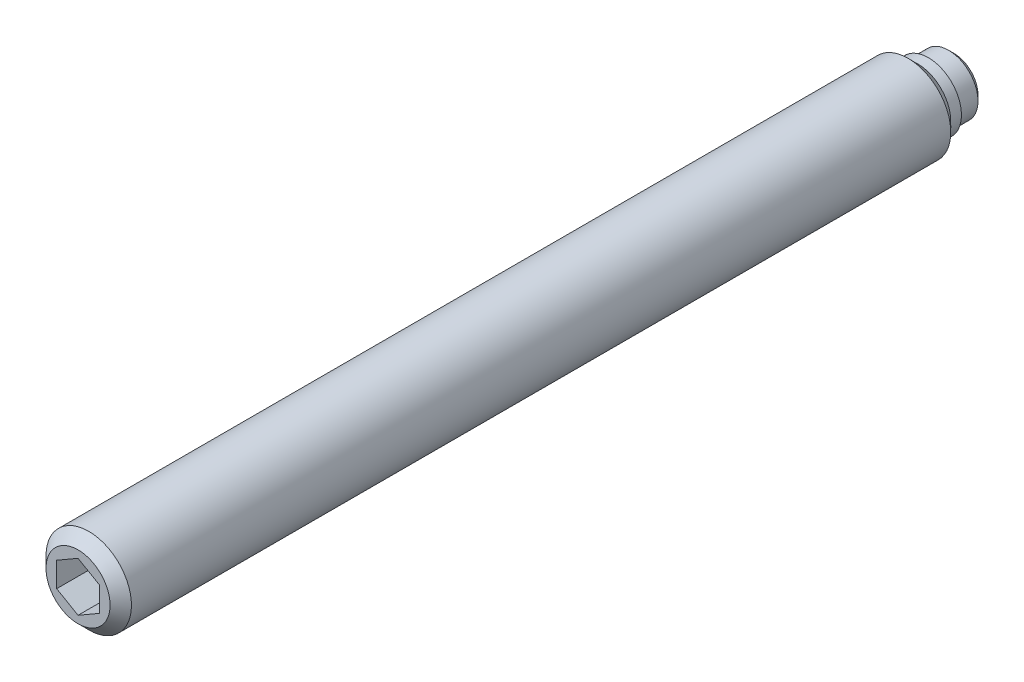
ISO-10303-21;
HEADER;
FILE_DESCRIPTION(('STEP AP214'),'2;1');
FILE_NAME('part.step','',(''),(''),'','','');
FILE_SCHEMA(('AUTOMOTIVE_DESIGN { 1 0 10303 214 1 1 1 1 }'));
ENDSEC;
DATA;
#1=APPLICATION_CONTEXT('core data for automotive mechanical design processes');
#2=APPLICATION_PROTOCOL_DEFINITION('international standard','automotive_design',2000,#1);
#3=PRODUCT_CONTEXT('',#1,'mechanical');
#4=PRODUCT('Part','Part','',(#3));
#5=PRODUCT_RELATED_PRODUCT_CATEGORY('part','',(#4));
#6=PRODUCT_DEFINITION_FORMATION('','',#4);
#7=PRODUCT_DEFINITION_CONTEXT('part definition',#1,'design');
#8=PRODUCT_DEFINITION('design','',#6,#7);
#9=PRODUCT_DEFINITION_SHAPE('','',#8);
#10=(LENGTH_UNIT() NAMED_UNIT(*) SI_UNIT(.MILLI.,.METRE.));
#11=(NAMED_UNIT(*) PLANE_ANGLE_UNIT() SI_UNIT($,.RADIAN.));
#12=(NAMED_UNIT(*) SI_UNIT($,.STERADIAN.) SOLID_ANGLE_UNIT());
#13=UNCERTAINTY_MEASURE_WITH_UNIT(LENGTH_MEASURE(1.E-05),#10,'distance_accuracy_value','');
#14=(GEOMETRIC_REPRESENTATION_CONTEXT(3) GLOBAL_UNCERTAINTY_ASSIGNED_CONTEXT((#13)) GLOBAL_UNIT_ASSIGNED_CONTEXT((#10,
#11,#12)) REPRESENTATION_CONTEXT('',''));
#15=CARTESIAN_POINT('',(0.,0.,0.));
#16=DIRECTION('',(0.,0.,1.));
#17=DIRECTION('',(1.,0.,0.));
#18=AXIS2_PLACEMENT_3D('',#15,#16,#17);
#19=CARTESIAN_POINT('',(0.,0.,2.4));
#20=DIRECTION('',(0.,0.,-1.));
#21=DIRECTION('',(-1.,0.,0.));
#22=AXIS2_PLACEMENT_3D('',#19,#20,#21);
#23=CYLINDRICAL_SURFACE('',#22,4.);
#24=CARTESIAN_POINT('',(0.,0.,4.3));
#25=DIRECTION('',(0.,0.,-1.));
#26=DIRECTION('',(-1.,0.,0.));
#27=AXIS2_PLACEMENT_3D('',#24,#25,#26);
#28=CIRCLE('',#27,4.);
#29=CARTESIAN_POINT('',(-4.,0.,4.3));
#30=VERTEX_POINT('',#29);
#31=EDGE_CURVE('E9',#30,#30,#28,.T.);
#32=ORIENTED_EDGE('',*,*,#31,.F.);
#33=EDGE_LOOP('',(#32));
#34=FACE_BOUND('',#33,.T.);
#35=CARTESIAN_POINT('',(0.,0.,81.));
#36=DIRECTION('',(0.,0.,1.));
#37=DIRECTION('',(1.,0.,0.));
#38=AXIS2_PLACEMENT_3D('',#35,#36,#37);
#39=CIRCLE('',#38,4.);
#40=CARTESIAN_POINT('',(4.,0.,81.));
#41=VERTEX_POINT('',#40);
#42=EDGE_CURVE('E70',#41,#41,#39,.T.);
#43=ORIENTED_EDGE('',*,*,#42,.F.);
#44=EDGE_LOOP('',(#43));
#45=FACE_BOUND('',#44,.T.);
#46=ADVANCED_FACE('F14',(#34,#45),#23,.T.);
#47=CARTESIAN_POINT('',(0.,0.,4.3));
#48=DIRECTION('',(0.,0.,1.));
#49=DIRECTION('',(1.,0.,0.));
#50=AXIS2_PLACEMENT_3D('',#47,#48,#49);
#51=CONICAL_SURFACE('',#50,4.,0.785398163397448);
#52=ORIENTED_EDGE('',*,*,#31,.T.);
#53=EDGE_LOOP('',(#52));
#54=FACE_BOUND('',#53,.T.);
#55=CARTESIAN_POINT('',(0.,0.,3.4));
#56=DIRECTION('',(0.,0.,-1.));
#57=DIRECTION('',(-1.,0.,0.));
#58=AXIS2_PLACEMENT_3D('',#55,#56,#57);
#59=CIRCLE('',#58,3.1);
#60=CARTESIAN_POINT('',(-3.1,0.,3.4));
#61=VERTEX_POINT('',#60);
#62=EDGE_CURVE('E21',#61,#61,#59,.T.);
#63=ORIENTED_EDGE('',*,*,#62,.F.);
#64=EDGE_LOOP('',(#63));
#65=FACE_BOUND('',#64,.T.);
#66=ADVANCED_FACE('F139',(#54,#65),#51,.T.);
#67=CARTESIAN_POINT('',(0.,0.,2.4));
#68=DIRECTION('',(0.,0.,-1.));
#69=DIRECTION('',(-1.,0.,0.));
#70=AXIS2_PLACEMENT_3D('',#67,#68,#69);
#71=CYLINDRICAL_SURFACE('',#70,3.1);
#72=ORIENTED_EDGE('',*,*,#62,.T.);
#73=EDGE_LOOP('',(#72));
#74=FACE_BOUND('',#73,.T.);
#75=CARTESIAN_POINT('',(0.,0.,2.4));
#76=DIRECTION('',(0.,0.,-1.));
#77=DIRECTION('',(-1.,0.,0.));
#78=AXIS2_PLACEMENT_3D('',#75,#76,#77);
#79=CIRCLE('',#78,3.1);
#80=CARTESIAN_POINT('',(-3.1,0.,2.4));
#81=VERTEX_POINT('',#80);
#82=EDGE_CURVE('E131',#81,#81,#79,.T.);
#83=ORIENTED_EDGE('',*,*,#82,.F.);
#84=EDGE_LOOP('',(#83));
#85=FACE_BOUND('',#84,.T.);
#86=ADVANCED_FACE('F136',(#74,#85),#71,.T.);
#87=CARTESIAN_POINT('',(0.,3.1,2.4));
#88=DIRECTION('',(0.,0.,1.));
#89=DIRECTION('',(1.,0.,0.));
#90=AXIS2_PLACEMENT_3D('',#87,#88,#89);
#91=PLANE('',#90);
#92=ORIENTED_EDGE('',*,*,#82,.T.);
#93=EDGE_LOOP('',(#92));
#94=FACE_BOUND('',#93,.T.);
#95=CARTESIAN_POINT('',(0.,0.,2.4));
#96=DIRECTION('',(0.,0.,-1.));
#97=DIRECTION('',(-1.,0.,0.));
#98=AXIS2_PLACEMENT_3D('',#95,#96,#97);
#99=CIRCLE('',#98,2.75);
#100=CARTESIAN_POINT('',(-2.75,0.,2.4));
#101=VERTEX_POINT('',#100);
#102=EDGE_CURVE('E128',#101,#101,#99,.T.);
#103=ORIENTED_EDGE('',*,*,#102,.F.);
#104=EDGE_LOOP('',(#103));
#105=FACE_BOUND('',#104,.T.);
#106=ADVANCED_FACE('F147',(#94,#105),#91,.F.);
#107=CARTESIAN_POINT('',(0.,0.,0.));
#108=DIRECTION('',(0.,0.,-1.));
#109=DIRECTION('',(-1.,0.,0.));
#110=AXIS2_PLACEMENT_3D('',#107,#108,#109);
#111=CYLINDRICAL_SURFACE('',#110,2.75);
#112=CARTESIAN_POINT('',(0.,0.,0.5));
#113=DIRECTION('',(0.,0.,-1.));
#114=DIRECTION('',(-1.,0.,0.));
#115=AXIS2_PLACEMENT_3D('',#112,#113,#114);
#116=CIRCLE('',#115,2.75);
#117=CARTESIAN_POINT('',(-2.75,0.,0.5));
#118=VERTEX_POINT('',#117);
#119=EDGE_CURVE('E125',#118,#118,#116,.T.);
#120=ORIENTED_EDGE('',*,*,#119,.F.);
#121=EDGE_LOOP('',(#120));
#122=FACE_BOUND('',#121,.T.);
#123=ORIENTED_EDGE('',*,*,#102,.T.);
#124=EDGE_LOOP('',(#123));
#125=FACE_BOUND('',#124,.T.);
#126=ADVANCED_FACE('F153',(#122,#125),#111,.T.);
#127=CARTESIAN_POINT('',(0.,0.,0.5));
#128=DIRECTION('',(0.,0.,1.));
#129=DIRECTION('',(1.,0.,0.));
#130=AXIS2_PLACEMENT_3D('',#127,#128,#129);
#131=CONICAL_SURFACE('',#130,2.75,0.785398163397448);
#132=CARTESIAN_POINT('',(0.,0.,0.));
#133=DIRECTION('',(0.,0.,-1.));
#134=DIRECTION('',(-1.,0.,0.));
#135=AXIS2_PLACEMENT_3D('',#132,#133,#134);
#136=CIRCLE('',#135,2.25);
#137=CARTESIAN_POINT('',(-2.25,0.,0.));
#138=VERTEX_POINT('',#137);
#139=EDGE_CURVE('E122',#138,#138,#136,.T.);
#140=ORIENTED_EDGE('',*,*,#139,.F.);
#141=EDGE_LOOP('',(#140));
#142=FACE_BOUND('',#141,.T.);
#143=ORIENTED_EDGE('',*,*,#119,.T.);
#144=EDGE_LOOP('',(#143));
#145=FACE_BOUND('',#144,.T.);
#146=ADVANCED_FACE('F157',(#142,#145),#131,.T.);
#147=CARTESIAN_POINT('',(0.,2.25,0.));
#148=DIRECTION('',(0.,0.,1.));
#149=DIRECTION('',(1.,0.,0.));
#150=AXIS2_PLACEMENT_3D('',#147,#148,#149);
#151=PLANE('',#150);
#152=ORIENTED_EDGE('',*,*,#139,.T.);
#153=EDGE_LOOP('',(#152));
#154=FACE_BOUND('',#153,.T.);
#155=ADVANCED_FACE('F161',(#154),#151,.F.);
#156=CARTESIAN_POINT('',(0.,0.,82.));
#157=DIRECTION('',(0.,0.,1.));
#158=DIRECTION('',(1.,0.,0.));
#159=AXIS2_PLACEMENT_3D('',#156,#157,#158);
#160=PLANE('',#159);
#161=DIRECTION('',(0.866025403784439,-0.5,0.));
#162=VECTOR('',#161,1.);
#163=CARTESIAN_POINT('',(-2.,-1.15470053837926,82.));
#164=LINE('',#163,#162);
#165=CARTESIAN_POINT('',(-2.,-1.15470053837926,82.));
#166=VERTEX_POINT('',#165);
#167=CARTESIAN_POINT('',(0.,-2.30940107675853,82.));
#168=VERTEX_POINT('',#167);
#169=EDGE_CURVE('E28',#166,#168,#164,.T.);
#170=ORIENTED_EDGE('',*,*,#169,.F.);
#171=DIRECTION('',(0.,-1.,0.));
#172=VECTOR('',#171,1.);
#173=CARTESIAN_POINT('',(-2.,1.15470053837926,82.));
#174=LINE('',#173,#172);
#175=CARTESIAN_POINT('',(-2.,1.15470053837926,82.));
#176=VERTEX_POINT('',#175);
#177=EDGE_CURVE('E69',#176,#166,#174,.T.);
#178=ORIENTED_EDGE('',*,*,#177,.F.);
#179=DIRECTION('',(-0.866025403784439,-0.5,0.));
#180=VECTOR('',#179,1.);
#181=CARTESIAN_POINT('',(0.,2.30940107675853,82.));
#182=LINE('',#181,#180);
#183=CARTESIAN_POINT('',(0.,2.30940107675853,82.));
#184=VERTEX_POINT('',#183);
#185=EDGE_CURVE('E105',#184,#176,#182,.T.);
#186=ORIENTED_EDGE('',*,*,#185,.F.);
#187=DIRECTION('',(-0.866025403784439,0.5,0.));
#188=VECTOR('',#187,1.);
#189=CARTESIAN_POINT('',(2.,1.15470053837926,82.));
#190=LINE('',#189,#188);
#191=CARTESIAN_POINT('',(2.,1.15470053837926,82.));
#192=VERTEX_POINT('',#191);
#193=EDGE_CURVE('E102',#192,#184,#190,.T.);
#194=ORIENTED_EDGE('',*,*,#193,.F.);
#195=DIRECTION('',(0.,1.,0.));
#196=VECTOR('',#195,1.);
#197=CARTESIAN_POINT('',(2.,-1.15470053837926,82.));
#198=LINE('',#197,#196);
#199=CARTESIAN_POINT('',(2.,-1.15470053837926,82.));
#200=VERTEX_POINT('',#199);
#201=EDGE_CURVE('E99',#200,#192,#198,.T.);
#202=ORIENTED_EDGE('',*,*,#201,.F.);
#203=DIRECTION('',(0.866025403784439,0.5,0.));
#204=VECTOR('',#203,1.);
#205=CARTESIAN_POINT('',(0.,-2.30940107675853,82.));
#206=LINE('',#205,#204);
#207=EDGE_CURVE('E96',#168,#200,#206,.T.);
#208=ORIENTED_EDGE('',*,*,#207,.F.);
#209=EDGE_LOOP('',(#170,#178,#186,#194,#202,#208));
#210=FACE_BOUND('',#209,.T.);
#211=CARTESIAN_POINT('',(0.,0.,82.));
#212=DIRECTION('',(0.,0.,1.));
#213=DIRECTION('',(1.,0.,0.));
#214=AXIS2_PLACEMENT_3D('',#211,#212,#213);
#215=CIRCLE('',#214,3.);
#216=CARTESIAN_POINT('',(3.,0.,82.));
#217=VERTEX_POINT('',#216);
#218=EDGE_CURVE('E119',#217,#217,#215,.T.);
#219=ORIENTED_EDGE('',*,*,#218,.T.);
#220=EDGE_LOOP('',(#219));
#221=FACE_BOUND('',#220,.T.);
#222=ADVANCED_FACE('F165',(#210,#221),#160,.T.);
#223=CARTESIAN_POINT('',(0.,0.,82.));
#224=DIRECTION('',(0.,0.,-1.));
#225=DIRECTION('',(-1.,0.,0.));
#226=AXIS2_PLACEMENT_3D('',#223,#224,#225);
#227=CONICAL_SURFACE('',#226,3.,0.785398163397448);
#228=ORIENTED_EDGE('',*,*,#42,.T.);
#229=EDGE_LOOP('',(#228));
#230=FACE_BOUND('',#229,.T.);
#231=ORIENTED_EDGE('',*,*,#218,.F.);
#232=EDGE_LOOP('',(#231));
#233=FACE_BOUND('',#232,.T.);
#234=ADVANCED_FACE('F169',(#230,#233),#227,.T.);
#235=CARTESIAN_POINT('',(-2.,-1.15470053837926,79.));
#236=DIRECTION('',(-0.5,-0.866025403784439,0.));
#237=DIRECTION('',(0.866025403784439,-0.5,0.));
#238=AXIS2_PLACEMENT_3D('',#235,#236,#237);
#239=PLANE('',#238);
#240=ORIENTED_EDGE('',*,*,#169,.T.);
#241=DIRECTION('',(0.,0.,1.));
#242=VECTOR('',#241,1.);
#243=CARTESIAN_POINT('',(0.,-2.30940107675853,79.));
#244=LINE('',#243,#242);
#245=CARTESIAN_POINT('',(0.,-2.30940107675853,77.));
#246=VERTEX_POINT('',#245);
#247=EDGE_CURVE('E76',#246,#168,#244,.T.);
#248=ORIENTED_EDGE('',*,*,#247,.F.);
#249=DIRECTION('',(0.866025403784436,-0.5,0.));
#250=VECTOR('',#249,1.);
#251=CARTESIAN_POINT('',(-2.,-1.15470053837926,77.));
#252=LINE('',#251,#250);
#253=CARTESIAN_POINT('',(-2.,-1.15470053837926,77.));
#254=VERTEX_POINT('',#253);
#255=EDGE_CURVE('E74',#254,#246,#252,.T.);
#256=ORIENTED_EDGE('',*,*,#255,.F.);
#257=DIRECTION('',(0.,0.,1.));
#258=VECTOR('',#257,1.);
#259=CARTESIAN_POINT('',(-2.,-1.15470053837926,79.));
#260=LINE('',#259,#258);
#261=EDGE_CURVE('E33',#254,#166,#260,.T.);
#262=ORIENTED_EDGE('',*,*,#261,.T.);
#263=EDGE_LOOP('',(#240,#248,#256,#262));
#264=FACE_BOUND('',#263,.T.);
#265=ADVANCED_FACE('F75',(#264),#239,.F.);
#266=CARTESIAN_POINT('',(-2.,1.15470053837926,79.));
#267=DIRECTION('',(-1.,0.,0.));
#268=DIRECTION('',(0.,0.,1.));
#269=AXIS2_PLACEMENT_3D('',#266,#267,#268);
#270=PLANE('',#269);
#271=ORIENTED_EDGE('',*,*,#177,.T.);
#272=ORIENTED_EDGE('',*,*,#261,.F.);
#273=DIRECTION('',(0.,-1.,0.));
#274=VECTOR('',#273,1.);
#275=CARTESIAN_POINT('',(-2.,1.15470053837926,77.));
#276=LINE('',#275,#274);
#277=CARTESIAN_POINT('',(-2.,1.15470053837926,77.));
#278=VERTEX_POINT('',#277);
#279=EDGE_CURVE('E66',#278,#254,#276,.T.);
#280=ORIENTED_EDGE('',*,*,#279,.F.);
#281=DIRECTION('',(0.,0.,1.));
#282=VECTOR('',#281,1.);
#283=CARTESIAN_POINT('',(-2.,1.15470053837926,79.));
#284=LINE('',#283,#282);
#285=EDGE_CURVE('E71',#278,#176,#284,.T.);
#286=ORIENTED_EDGE('',*,*,#285,.T.);
#287=EDGE_LOOP('',(#271,#272,#280,#286));
#288=FACE_BOUND('',#287,.T.);
#289=ADVANCED_FACE('F64',(#288),#270,.F.);
#290=CARTESIAN_POINT('',(0.,2.30940107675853,79.));
#291=DIRECTION('',(-0.5,0.866025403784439,0.));
#292=DIRECTION('',(-0.866025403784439,-0.5,0.));
#293=AXIS2_PLACEMENT_3D('',#290,#291,#292);
#294=PLANE('',#293);
#295=ORIENTED_EDGE('',*,*,#185,.T.);
#296=ORIENTED_EDGE('',*,*,#285,.F.);
#297=DIRECTION('',(-0.866025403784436,-0.5,0.));
#298=VECTOR('',#297,1.);
#299=CARTESIAN_POINT('',(0.,2.30940107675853,77.));
#300=LINE('',#299,#298);
#301=CARTESIAN_POINT('',(0.,2.30940107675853,77.));
#302=VERTEX_POINT('',#301);
#303=EDGE_CURVE('E85',#302,#278,#300,.T.);
#304=ORIENTED_EDGE('',*,*,#303,.F.);
#305=DIRECTION('',(0.,0.,1.));
#306=VECTOR('',#305,1.);
#307=CARTESIAN_POINT('',(0.,2.30940107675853,79.));
#308=LINE('',#307,#306);
#309=EDGE_CURVE('E110',#302,#184,#308,.T.);
#310=ORIENTED_EDGE('',*,*,#309,.T.);
#311=EDGE_LOOP('',(#295,#296,#304,#310));
#312=FACE_BOUND('',#311,.T.);
#313=ADVANCED_FACE('F187',(#312),#294,.F.);
#314=CARTESIAN_POINT('',(2.,1.15470053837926,79.));
#315=DIRECTION('',(0.5,0.866025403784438,0.));
#316=DIRECTION('',(-0.866025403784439,0.5,0.));
#317=AXIS2_PLACEMENT_3D('',#314,#315,#316);
#318=PLANE('',#317);
#319=ORIENTED_EDGE('',*,*,#193,.T.);
#320=ORIENTED_EDGE('',*,*,#309,.F.);
#321=DIRECTION('',(-0.866025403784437,0.5,0.));
#322=VECTOR('',#321,1.);
#323=CARTESIAN_POINT('',(2.,1.15470053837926,77.));
#324=LINE('',#323,#322);
#325=CARTESIAN_POINT('',(2.,1.15470053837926,77.));
#326=VERTEX_POINT('',#325);
#327=EDGE_CURVE('E92',#326,#302,#324,.T.);
#328=ORIENTED_EDGE('',*,*,#327,.F.);
#329=DIRECTION('',(0.,0.,1.));
#330=VECTOR('',#329,1.);
#331=CARTESIAN_POINT('',(2.,1.15470053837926,79.));
#332=LINE('',#331,#330);
#333=EDGE_CURVE('E112',#326,#192,#332,.T.);
#334=ORIENTED_EDGE('',*,*,#333,.T.);
#335=EDGE_LOOP('',(#319,#320,#328,#334));
#336=FACE_BOUND('',#335,.T.);
#337=ADVANCED_FACE('F183',(#336),#318,.F.);
#338=CARTESIAN_POINT('',(2.,-1.15470053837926,79.));
#339=DIRECTION('',(1.,0.,0.));
#340=DIRECTION('',(0.,0.,-1.));
#341=AXIS2_PLACEMENT_3D('',#338,#339,#340);
#342=PLANE('',#341);
#343=ORIENTED_EDGE('',*,*,#201,.T.);
#344=ORIENTED_EDGE('',*,*,#333,.F.);
#345=DIRECTION('',(0.,1.,0.));
#346=VECTOR('',#345,1.);
#347=CARTESIAN_POINT('',(2.,-1.15470053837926,77.));
#348=LINE('',#347,#346);
#349=CARTESIAN_POINT('',(2.,-1.15470053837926,77.));
#350=VERTEX_POINT('',#349);
#351=EDGE_CURVE('E89',#350,#326,#348,.T.);
#352=ORIENTED_EDGE('',*,*,#351,.F.);
#353=DIRECTION('',(0.,0.,1.));
#354=VECTOR('',#353,1.);
#355=CARTESIAN_POINT('',(2.,-1.15470053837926,79.));
#356=LINE('',#355,#354);
#357=EDGE_CURVE('E114',#350,#200,#356,.T.);
#358=ORIENTED_EDGE('',*,*,#357,.T.);
#359=EDGE_LOOP('',(#343,#344,#352,#358));
#360=FACE_BOUND('',#359,.T.);
#361=ADVANCED_FACE('F179',(#360),#342,.F.);
#362=CARTESIAN_POINT('',(0.,-2.30940107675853,79.));
#363=DIRECTION('',(0.5,-0.866025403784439,0.));
#364=DIRECTION('',(0.866025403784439,0.5,0.));
#365=AXIS2_PLACEMENT_3D('',#362,#363,#364);
#366=PLANE('',#365);
#367=ORIENTED_EDGE('',*,*,#207,.T.);
#368=ORIENTED_EDGE('',*,*,#357,.F.);
#369=DIRECTION('',(0.866025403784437,0.5,0.));
#370=VECTOR('',#369,1.);
#371=CARTESIAN_POINT('',(0.,-2.30940107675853,77.));
#372=LINE('',#371,#370);
#373=EDGE_CURVE('E80',#246,#350,#372,.T.);
#374=ORIENTED_EDGE('',*,*,#373,.F.);
#375=ORIENTED_EDGE('',*,*,#247,.T.);
#376=EDGE_LOOP('',(#367,#368,#374,#375));
#377=FACE_BOUND('',#376,.T.);
#378=ADVANCED_FACE('F176',(#377),#366,.F.);
#379=CARTESIAN_POINT('',(0.,0.,77.));
#380=DIRECTION('',(0.,0.,1.));
#381=DIRECTION('',(1.,0.,0.));
#382=AXIS2_PLACEMENT_3D('',#379,#380,#381);
#383=PLANE('',#382);
#384=ORIENTED_EDGE('',*,*,#279,.T.);
#385=ORIENTED_EDGE('',*,*,#255,.T.);
#386=ORIENTED_EDGE('',*,*,#373,.T.);
#387=ORIENTED_EDGE('',*,*,#351,.T.);
#388=ORIENTED_EDGE('',*,*,#327,.T.);
#389=ORIENTED_EDGE('',*,*,#303,.T.);
#390=EDGE_LOOP('',(#384,#385,#386,#387,#388,#389));
#391=FACE_BOUND('',#390,.T.);
#392=ADVANCED_FACE('F82',(#391),#383,.T.);
#393=CLOSED_SHELL('',(#46,#66,#86,#106,#126,#146,#155,#222,#234,#265,#289,#313,#337,#361,#378,#392));
#394=MANIFOLD_SOLID_BREP('B1',#393);
#395=ADVANCED_BREP_SHAPE_REPRESENTATION('',(#18,#394),#14);
#396=SHAPE_DEFINITION_REPRESENTATION(#9,#395);
ENDSEC;
END-ISO-10303-21;
